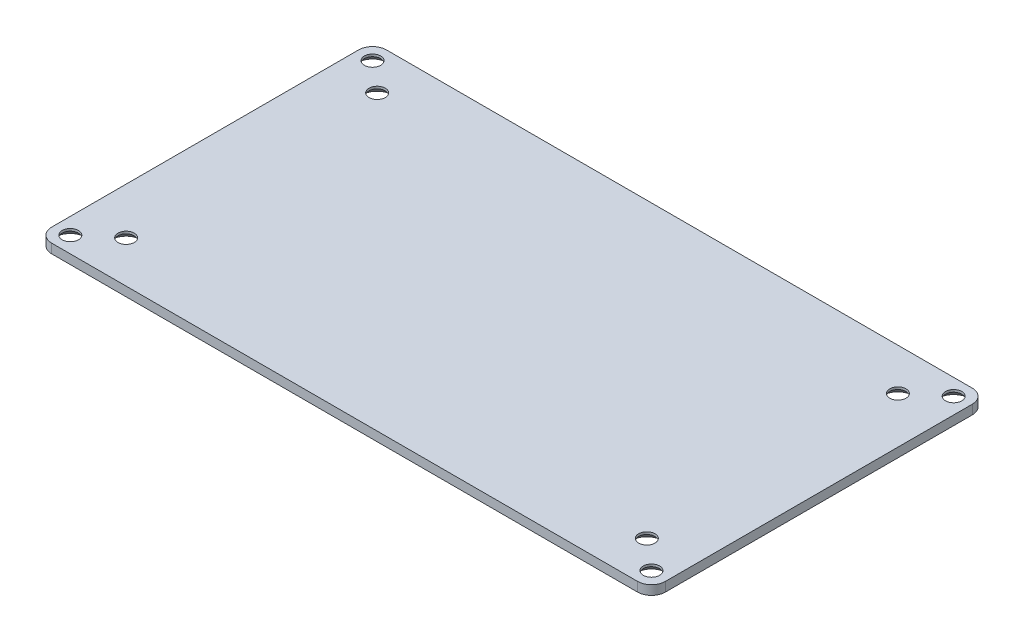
ISO-10303-21;
HEADER;
FILE_DESCRIPTION(('STEP AP214'),'2;1');
FILE_NAME('part.step','',(''),(''),'','','');
FILE_SCHEMA(('AUTOMOTIVE_DESIGN { 1 0 10303 214 1 1 1 1 }'));
ENDSEC;
DATA;
#1=APPLICATION_CONTEXT('core data for automotive mechanical design processes');
#2=APPLICATION_PROTOCOL_DEFINITION('international standard','automotive_design',2000,#1);
#3=PRODUCT_CONTEXT('',#1,'mechanical');
#4=PRODUCT('Part','Part','',(#3));
#5=PRODUCT_RELATED_PRODUCT_CATEGORY('part','',(#4));
#6=PRODUCT_DEFINITION_FORMATION('','',#4);
#7=PRODUCT_DEFINITION_CONTEXT('part definition',#1,'design');
#8=PRODUCT_DEFINITION('design','',#6,#7);
#9=PRODUCT_DEFINITION_SHAPE('','',#8);
#10=(LENGTH_UNIT() NAMED_UNIT(*) SI_UNIT(.MILLI.,.METRE.));
#11=(NAMED_UNIT(*) PLANE_ANGLE_UNIT() SI_UNIT($,.RADIAN.));
#12=(NAMED_UNIT(*) SI_UNIT($,.STERADIAN.) SOLID_ANGLE_UNIT());
#13=UNCERTAINTY_MEASURE_WITH_UNIT(LENGTH_MEASURE(1.E-05),#10,'distance_accuracy_value','');
#14=(GEOMETRIC_REPRESENTATION_CONTEXT(3) GLOBAL_UNCERTAINTY_ASSIGNED_CONTEXT((#13)) GLOBAL_UNIT_ASSIGNED_CONTEXT((#10,
#11,#12)) REPRESENTATION_CONTEXT('',''));
#15=CARTESIAN_POINT('',(0.,0.,0.));
#16=DIRECTION('',(0.,0.,1.));
#17=DIRECTION('',(1.,0.,0.));
#18=AXIS2_PLACEMENT_3D('',#15,#16,#17);
#19=CARTESIAN_POINT('',(-63.,2.,33.));
#20=DIRECTION('',(0.,-1.,0.));
#21=DIRECTION('',(0.,0.,-1.));
#22=AXIS2_PLACEMENT_3D('',#19,#20,#21);
#23=CYLINDRICAL_SURFACE('',#22,3.);
#24=CARTESIAN_POINT('',(-63.,0.,33.));
#25=DIRECTION('',(0.,1.,0.));
#26=DIRECTION('',(0.,0.,1.));
#27=AXIS2_PLACEMENT_3D('',#24,#25,#26);
#28=CIRCLE('',#27,3.);
#29=CARTESIAN_POINT('',(-66.,0.,33.));
#30=VERTEX_POINT('',#29);
#31=CARTESIAN_POINT('',(-63.,0.,36.));
#32=VERTEX_POINT('',#31);
#33=EDGE_CURVE('E135',#30,#32,#28,.T.);
#34=ORIENTED_EDGE('',*,*,#33,.T.);
#35=DIRECTION('',(0.,-1.,0.));
#36=VECTOR('',#35,1.);
#37=CARTESIAN_POINT('',(-63.,2.,36.));
#38=LINE('',#37,#36);
#39=CARTESIAN_POINT('',(-63.,2.,36.));
#40=VERTEX_POINT('',#39);
#41=EDGE_CURVE('E163',#40,#32,#38,.T.);
#42=ORIENTED_EDGE('',*,*,#41,.F.);
#43=CARTESIAN_POINT('',(-63.,2.,33.));
#44=DIRECTION('',(0.,1.,0.));
#45=DIRECTION('',(0.,0.,1.));
#46=AXIS2_PLACEMENT_3D('',#43,#44,#45);
#47=CIRCLE('',#46,3.);
#48=CARTESIAN_POINT('',(-66.,2.,33.));
#49=VERTEX_POINT('',#48);
#50=EDGE_CURVE('E150',#49,#40,#47,.T.);
#51=ORIENTED_EDGE('',*,*,#50,.F.);
#52=DIRECTION('',(0.,-1.,0.));
#53=VECTOR('',#52,1.);
#54=CARTESIAN_POINT('',(-66.,2.,33.));
#55=LINE('',#54,#53);
#56=EDGE_CURVE('E130',#49,#30,#55,.T.);
#57=ORIENTED_EDGE('',*,*,#56,.T.);
#58=EDGE_LOOP('',(#34,#42,#51,#57));
#59=FACE_BOUND('',#58,.T.);
#60=ADVANCED_FACE('F37',(#59),#23,.T.);
#61=CARTESIAN_POINT('',(-63.,2.,36.));
#62=DIRECTION('',(0.,0.,-1.));
#63=DIRECTION('',(-1.,0.,0.));
#64=AXIS2_PLACEMENT_3D('',#61,#62,#63);
#65=PLANE('',#64);
#66=DIRECTION('',(1.,0.,0.));
#67=VECTOR('',#66,1.);
#68=CARTESIAN_POINT('',(-63.,0.,36.));
#69=LINE('',#68,#67);
#70=CARTESIAN_POINT('',(63.,0.,36.));
#71=VERTEX_POINT('',#70);
#72=EDGE_CURVE('E138',#32,#71,#69,.T.);
#73=ORIENTED_EDGE('',*,*,#72,.T.);
#74=DIRECTION('',(0.,-1.,0.));
#75=VECTOR('',#74,1.);
#76=CARTESIAN_POINT('',(63.,2.,36.));
#77=LINE('',#76,#75);
#78=CARTESIAN_POINT('',(63.,2.,36.));
#79=VERTEX_POINT('',#78);
#80=EDGE_CURVE('E160',#79,#71,#77,.T.);
#81=ORIENTED_EDGE('',*,*,#80,.F.);
#82=DIRECTION('',(1.,0.,0.));
#83=VECTOR('',#82,1.);
#84=CARTESIAN_POINT('',(-63.,2.,36.));
#85=LINE('',#84,#83);
#86=EDGE_CURVE('E98',#40,#79,#85,.T.);
#87=ORIENTED_EDGE('',*,*,#86,.F.);
#88=ORIENTED_EDGE('',*,*,#41,.T.);
#89=EDGE_LOOP('',(#73,#81,#87,#88));
#90=FACE_BOUND('',#89,.T.);
#91=ADVANCED_FACE('F350',(#90),#65,.F.);
#92=CARTESIAN_POINT('',(63.,2.,33.));
#93=DIRECTION('',(0.,-1.,0.));
#94=DIRECTION('',(0.,0.,-1.));
#95=AXIS2_PLACEMENT_3D('',#92,#93,#94);
#96=CYLINDRICAL_SURFACE('',#95,3.);
#97=CARTESIAN_POINT('',(63.,0.,33.));
#98=DIRECTION('',(0.,1.,0.));
#99=DIRECTION('',(0.,0.,1.));
#100=AXIS2_PLACEMENT_3D('',#97,#98,#99);
#101=CIRCLE('',#100,3.);
#102=CARTESIAN_POINT('',(66.,0.,33.));
#103=VERTEX_POINT('',#102);
#104=EDGE_CURVE('E141',#71,#103,#101,.T.);
#105=ORIENTED_EDGE('',*,*,#104,.T.);
#106=DIRECTION('',(0.,-1.,0.));
#107=VECTOR('',#106,1.);
#108=CARTESIAN_POINT('',(66.,2.,33.));
#109=LINE('',#108,#107);
#110=CARTESIAN_POINT('',(66.,2.,33.));
#111=VERTEX_POINT('',#110);
#112=EDGE_CURVE('E157',#111,#103,#109,.T.);
#113=ORIENTED_EDGE('',*,*,#112,.F.);
#114=CARTESIAN_POINT('',(63.,2.,33.));
#115=DIRECTION('',(0.,1.,0.));
#116=DIRECTION('',(0.,0.,1.));
#117=AXIS2_PLACEMENT_3D('',#114,#115,#116);
#118=CIRCLE('',#117,3.);
#119=EDGE_CURVE('E648',#79,#111,#118,.T.);
#120=ORIENTED_EDGE('',*,*,#119,.F.);
#121=ORIENTED_EDGE('',*,*,#80,.T.);
#122=EDGE_LOOP('',(#105,#113,#120,#121));
#123=FACE_BOUND('',#122,.T.);
#124=ADVANCED_FACE('F355',(#123),#96,.T.);
#125=CARTESIAN_POINT('',(66.,2.,-33.));
#126=DIRECTION('',(-1.,0.,0.));
#127=DIRECTION('',(0.,0.,1.));
#128=AXIS2_PLACEMENT_3D('',#125,#126,#127);
#129=PLANE('',#128);
#130=DIRECTION('',(0.,0.,-1.));
#131=VECTOR('',#130,1.);
#132=CARTESIAN_POINT('',(66.,0.,-33.));
#133=LINE('',#132,#131);
#134=CARTESIAN_POINT('',(66.,0.,-33.));
#135=VERTEX_POINT('',#134);
#136=EDGE_CURVE('E143',#103,#135,#133,.T.);
#137=ORIENTED_EDGE('',*,*,#136,.T.);
#138=DIRECTION('',(0.,-1.,0.));
#139=VECTOR('',#138,1.);
#140=CARTESIAN_POINT('',(66.,2.,-33.));
#141=LINE('',#140,#139);
#142=CARTESIAN_POINT('',(66.,2.,-33.));
#143=VERTEX_POINT('',#142);
#144=EDGE_CURVE('E154',#143,#135,#141,.T.);
#145=ORIENTED_EDGE('',*,*,#144,.F.);
#146=DIRECTION('',(0.,0.,-1.));
#147=VECTOR('',#146,1.);
#148=CARTESIAN_POINT('',(66.,2.,-33.));
#149=LINE('',#148,#147);
#150=EDGE_CURVE('E646',#111,#143,#149,.T.);
#151=ORIENTED_EDGE('',*,*,#150,.F.);
#152=ORIENTED_EDGE('',*,*,#112,.T.);
#153=EDGE_LOOP('',(#137,#145,#151,#152));
#154=FACE_BOUND('',#153,.T.);
#155=ADVANCED_FACE('F608',(#154),#129,.F.);
#156=CARTESIAN_POINT('',(63.,2.,-33.));
#157=DIRECTION('',(0.,-1.,0.));
#158=DIRECTION('',(0.,0.,-1.));
#159=AXIS2_PLACEMENT_3D('',#156,#157,#158);
#160=CYLINDRICAL_SURFACE('',#159,3.);
#161=CARTESIAN_POINT('',(63.,0.,-33.));
#162=DIRECTION('',(0.,1.,0.));
#163=DIRECTION('',(0.,0.,-1.));
#164=AXIS2_PLACEMENT_3D('',#161,#162,#163);
#165=CIRCLE('',#164,3.);
#166=CARTESIAN_POINT('',(63.,0.,-36.));
#167=VERTEX_POINT('',#166);
#168=EDGE_CURVE('E145',#135,#167,#165,.T.);
#169=ORIENTED_EDGE('',*,*,#168,.T.);
#170=DIRECTION('',(0.,-1.,0.));
#171=VECTOR('',#170,1.);
#172=CARTESIAN_POINT('',(63.,2.,-36.));
#173=LINE('',#172,#171);
#174=CARTESIAN_POINT('',(63.,2.,-36.));
#175=VERTEX_POINT('',#174);
#176=EDGE_CURVE('E125',#175,#167,#173,.T.);
#177=ORIENTED_EDGE('',*,*,#176,.F.);
#178=CARTESIAN_POINT('',(63.,2.,-33.));
#179=DIRECTION('',(0.,1.,0.));
#180=DIRECTION('',(0.,0.,-1.));
#181=AXIS2_PLACEMENT_3D('',#178,#179,#180);
#182=CIRCLE('',#181,3.);
#183=EDGE_CURVE('E117',#143,#175,#182,.T.);
#184=ORIENTED_EDGE('',*,*,#183,.F.);
#185=ORIENTED_EDGE('',*,*,#144,.T.);
#186=EDGE_LOOP('',(#169,#177,#184,#185));
#187=FACE_BOUND('',#186,.T.);
#188=ADVANCED_FACE('F600',(#187),#160,.T.);
#189=CARTESIAN_POINT('',(-63.,2.,-36.));
#190=DIRECTION('',(0.,0.,1.));
#191=DIRECTION('',(1.,0.,0.));
#192=AXIS2_PLACEMENT_3D('',#189,#190,#191);
#193=PLANE('',#192);
#194=DIRECTION('',(-1.,0.,0.));
#195=VECTOR('',#194,1.);
#196=CARTESIAN_POINT('',(-63.,0.,-36.));
#197=LINE('',#196,#195);
#198=CARTESIAN_POINT('',(-63.,0.,-36.));
#199=VERTEX_POINT('',#198);
#200=EDGE_CURVE('E124',#167,#199,#197,.T.);
#201=ORIENTED_EDGE('',*,*,#200,.T.);
#202=DIRECTION('',(0.,-1.,0.));
#203=VECTOR('',#202,1.);
#204=CARTESIAN_POINT('',(-63.,2.,-36.));
#205=LINE('',#204,#203);
#206=CARTESIAN_POINT('',(-63.,2.,-36.));
#207=VERTEX_POINT('',#206);
#208=EDGE_CURVE('E121',#207,#199,#205,.T.);
#209=ORIENTED_EDGE('',*,*,#208,.F.);
#210=DIRECTION('',(-1.,0.,0.));
#211=VECTOR('',#210,1.);
#212=CARTESIAN_POINT('',(-63.,2.,-36.));
#213=LINE('',#212,#211);
#214=EDGE_CURVE('E111',#175,#207,#213,.T.);
#215=ORIENTED_EDGE('',*,*,#214,.F.);
#216=ORIENTED_EDGE('',*,*,#176,.T.);
#217=EDGE_LOOP('',(#201,#209,#215,#216));
#218=FACE_BOUND('',#217,.T.);
#219=ADVANCED_FACE('F122',(#218),#193,.F.);
#220=CARTESIAN_POINT('',(-63.,2.,-33.));
#221=DIRECTION('',(0.,-1.,0.));
#222=DIRECTION('',(0.,0.,-1.));
#223=AXIS2_PLACEMENT_3D('',#220,#221,#222);
#224=CYLINDRICAL_SURFACE('',#223,3.);
#225=CARTESIAN_POINT('',(-63.,0.,-33.));
#226=DIRECTION('',(0.,1.,0.));
#227=DIRECTION('',(0.,0.,1.));
#228=AXIS2_PLACEMENT_3D('',#225,#226,#227);
#229=CIRCLE('',#228,3.);
#230=CARTESIAN_POINT('',(-66.,0.,-33.));
#231=VERTEX_POINT('',#230);
#232=EDGE_CURVE('E83',#199,#231,#229,.T.);
#233=ORIENTED_EDGE('',*,*,#232,.T.);
#234=DIRECTION('',(0.,-1.,0.));
#235=VECTOR('',#234,1.);
#236=CARTESIAN_POINT('',(-66.,2.,-33.));
#237=LINE('',#236,#235);
#238=CARTESIAN_POINT('',(-66.,2.,-33.));
#239=VERTEX_POINT('',#238);
#240=EDGE_CURVE('E126',#239,#231,#237,.T.);
#241=ORIENTED_EDGE('',*,*,#240,.F.);
#242=CARTESIAN_POINT('',(-63.,2.,-33.));
#243=DIRECTION('',(0.,1.,0.));
#244=DIRECTION('',(0.,0.,1.));
#245=AXIS2_PLACEMENT_3D('',#242,#243,#244);
#246=CIRCLE('',#245,3.);
#247=EDGE_CURVE('E115',#207,#239,#246,.T.);
#248=ORIENTED_EDGE('',*,*,#247,.F.);
#249=ORIENTED_EDGE('',*,*,#208,.T.);
#250=EDGE_LOOP('',(#233,#241,#248,#249));
#251=FACE_BOUND('',#250,.T.);
#252=ADVANCED_FACE('F128',(#251),#224,.T.);
#253=CARTESIAN_POINT('',(-66.,2.,-33.));
#254=DIRECTION('',(1.,0.,0.));
#255=DIRECTION('',(0.,0.,-1.));
#256=AXIS2_PLACEMENT_3D('',#253,#254,#255);
#257=PLANE('',#256);
#258=DIRECTION('',(0.,0.,1.));
#259=VECTOR('',#258,1.);
#260=CARTESIAN_POINT('',(-66.,0.,-33.));
#261=LINE('',#260,#259);
#262=EDGE_CURVE('E89',#231,#30,#261,.T.);
#263=ORIENTED_EDGE('',*,*,#262,.T.);
#264=ORIENTED_EDGE('',*,*,#56,.F.);
#265=DIRECTION('',(0.,0.,1.));
#266=VECTOR('',#265,1.);
#267=CARTESIAN_POINT('',(-66.,2.,-33.));
#268=LINE('',#267,#266);
#269=EDGE_CURVE('E54',#239,#49,#268,.T.);
#270=ORIENTED_EDGE('',*,*,#269,.F.);
#271=ORIENTED_EDGE('',*,*,#240,.T.);
#272=EDGE_LOOP('',(#263,#264,#270,#271));
#273=FACE_BOUND('',#272,.T.);
#274=ADVANCED_FACE('F339',(#273),#257,.F.);
#275=CARTESIAN_POINT('',(-63.,2.,33.));
#276=DIRECTION('',(0.,1.,0.));
#277=DIRECTION('',(0.,0.,1.));
#278=AXIS2_PLACEMENT_3D('',#275,#276,#277);
#279=PLANE('',#278);
#280=CARTESIAN_POINT('',(-56.,2.,27.));
#281=DIRECTION('',(0.,1.,0.));
#282=DIRECTION('',(0.,0.,1.));
#283=AXIS2_PLACEMENT_3D('',#280,#281,#282);
#284=CIRCLE('',#283,1.75);
#285=CARTESIAN_POINT('',(-56.,2.,28.75));
#286=VERTEX_POINT('',#285);
#287=EDGE_CURVE('E257',#286,#286,#284,.T.);
#288=ORIENTED_EDGE('',*,*,#287,.F.);
#289=EDGE_LOOP('',(#288));
#290=FACE_BOUND('',#289,.T.);
#291=CARTESIAN_POINT('',(56.,2.,27.));
#292=DIRECTION('',(0.,1.,0.));
#293=DIRECTION('',(0.,0.,1.));
#294=AXIS2_PLACEMENT_3D('',#291,#292,#293);
#295=CIRCLE('',#294,1.75);
#296=CARTESIAN_POINT('',(56.,2.,28.75));
#297=VERTEX_POINT('',#296);
#298=EDGE_CURVE('E267',#297,#297,#295,.T.);
#299=ORIENTED_EDGE('',*,*,#298,.F.);
#300=EDGE_LOOP('',(#299));
#301=FACE_BOUND('',#300,.T.);
#302=CARTESIAN_POINT('',(56.,2.,-27.));
#303=DIRECTION('',(0.,1.,0.));
#304=DIRECTION('',(0.,0.,1.));
#305=AXIS2_PLACEMENT_3D('',#302,#303,#304);
#306=CIRCLE('',#305,1.75);
#307=CARTESIAN_POINT('',(56.,2.,-25.25));
#308=VERTEX_POINT('',#307);
#309=EDGE_CURVE('E256',#308,#308,#306,.T.);
#310=ORIENTED_EDGE('',*,*,#309,.F.);
#311=EDGE_LOOP('',(#310));
#312=FACE_BOUND('',#311,.T.);
#313=CARTESIAN_POINT('',(-56.,2.,-27.));
#314=DIRECTION('',(0.,1.,0.));
#315=DIRECTION('',(0.,0.,1.));
#316=AXIS2_PLACEMENT_3D('',#313,#314,#315);
#317=CIRCLE('',#316,1.75);
#318=CARTESIAN_POINT('',(-56.,2.,-25.25));
#319=VERTEX_POINT('',#318);
#320=EDGE_CURVE('E242',#319,#319,#317,.T.);
#321=ORIENTED_EDGE('',*,*,#320,.F.);
#322=EDGE_LOOP('',(#321));
#323=FACE_BOUND('',#322,.T.);
#324=CARTESIAN_POINT('',(-62.5,2.,32.5));
#325=DIRECTION('',(0.,1.,0.));
#326=DIRECTION('',(0.,0.,1.));
#327=AXIS2_PLACEMENT_3D('',#324,#325,#326);
#328=CIRCLE('',#327,1.75);
#329=CARTESIAN_POINT('',(-62.5,2.,34.25));
#330=VERTEX_POINT('',#329);
#331=EDGE_CURVE('E236',#330,#330,#328,.T.);
#332=ORIENTED_EDGE('',*,*,#331,.F.);
#333=EDGE_LOOP('',(#332));
#334=FACE_BOUND('',#333,.T.);
#335=CARTESIAN_POINT('',(62.5,2.,32.5));
#336=DIRECTION('',(0.,1.,0.));
#337=DIRECTION('',(0.,0.,1.));
#338=AXIS2_PLACEMENT_3D('',#335,#336,#337);
#339=CIRCLE('',#338,1.75);
#340=CARTESIAN_POINT('',(62.5,2.,34.25));
#341=VERTEX_POINT('',#340);
#342=EDGE_CURVE('E241',#341,#341,#339,.T.);
#343=ORIENTED_EDGE('',*,*,#342,.F.);
#344=EDGE_LOOP('',(#343));
#345=FACE_BOUND('',#344,.T.);
#346=CARTESIAN_POINT('',(62.5,2.,-32.5));
#347=DIRECTION('',(0.,1.,0.));
#348=DIRECTION('',(0.,0.,1.));
#349=AXIS2_PLACEMENT_3D('',#346,#347,#348);
#350=CIRCLE('',#349,1.75);
#351=CARTESIAN_POINT('',(62.5,2.,-30.75));
#352=VERTEX_POINT('',#351);
#353=EDGE_CURVE('E248',#352,#352,#350,.T.);
#354=ORIENTED_EDGE('',*,*,#353,.F.);
#355=EDGE_LOOP('',(#354));
#356=FACE_BOUND('',#355,.T.);
#357=CARTESIAN_POINT('',(-62.5,2.,-32.5));
#358=DIRECTION('',(0.,1.,0.));
#359=DIRECTION('',(0.,0.,1.));
#360=AXIS2_PLACEMENT_3D('',#357,#358,#359);
#361=CIRCLE('',#360,1.75);
#362=CARTESIAN_POINT('',(-62.5,2.,-30.75));
#363=VERTEX_POINT('',#362);
#364=EDGE_CURVE('E139',#363,#363,#361,.T.);
#365=ORIENTED_EDGE('',*,*,#364,.F.);
#366=EDGE_LOOP('',(#365));
#367=FACE_BOUND('',#366,.T.);
#368=ORIENTED_EDGE('',*,*,#50,.T.);
#369=ORIENTED_EDGE('',*,*,#86,.T.);
#370=ORIENTED_EDGE('',*,*,#119,.T.);
#371=ORIENTED_EDGE('',*,*,#150,.T.);
#372=ORIENTED_EDGE('',*,*,#183,.T.);
#373=ORIENTED_EDGE('',*,*,#214,.T.);
#374=ORIENTED_EDGE('',*,*,#247,.T.);
#375=ORIENTED_EDGE('',*,*,#269,.T.);
#376=EDGE_LOOP('',(#368,#369,#370,#371,#372,#373,#374,#375));
#377=FACE_BOUND('',#376,.T.);
#378=ADVANCED_FACE('F113',(#290,#301,#312,#323,#334,#345,#356,#367,#377),#279,.T.);
#379=CARTESIAN_POINT('',(-63.,0.,33.));
#380=DIRECTION('',(0.,1.,0.));
#381=DIRECTION('',(0.,0.,1.));
#382=AXIS2_PLACEMENT_3D('',#379,#380,#381);
#383=PLANE('',#382);
#384=CARTESIAN_POINT('',(45.,0.,25.));
#385=DIRECTION('',(0.,-1.,0.));
#386=DIRECTION('',(0.,0.,-1.));
#387=AXIS2_PLACEMENT_3D('',#384,#385,#386);
#388=CIRCLE('',#387,6.25);
#389=CARTESIAN_POINT('',(45.,0.,18.75));
#390=VERTEX_POINT('',#389);
#391=EDGE_CURVE('E291',#390,#390,#388,.T.);
#392=ORIENTED_EDGE('',*,*,#391,.F.);
#393=EDGE_LOOP('',(#392));
#394=FACE_BOUND('',#393,.T.);
#395=CARTESIAN_POINT('',(-45.,0.,-25.));
#396=DIRECTION('',(0.,-1.,0.));
#397=DIRECTION('',(0.,0.,-1.));
#398=AXIS2_PLACEMENT_3D('',#395,#396,#397);
#399=CIRCLE('',#398,6.25);
#400=CARTESIAN_POINT('',(-45.,0.,-31.25));
#401=VERTEX_POINT('',#400);
#402=EDGE_CURVE('E284',#401,#401,#399,.T.);
#403=ORIENTED_EDGE('',*,*,#402,.F.);
#404=EDGE_LOOP('',(#403));
#405=FACE_BOUND('',#404,.T.);
#406=CARTESIAN_POINT('',(45.,0.,-25.));
#407=DIRECTION('',(0.,-1.,0.));
#408=DIRECTION('',(0.,0.,-1.));
#409=AXIS2_PLACEMENT_3D('',#406,#407,#408);
#410=CIRCLE('',#409,6.25);
#411=CARTESIAN_POINT('',(45.,0.,-31.25));
#412=VERTEX_POINT('',#411);
#413=EDGE_CURVE('E296',#412,#412,#410,.T.);
#414=ORIENTED_EDGE('',*,*,#413,.F.);
#415=EDGE_LOOP('',(#414));
#416=FACE_BOUND('',#415,.T.);
#417=CARTESIAN_POINT('',(-45.,0.,25.));
#418=DIRECTION('',(0.,-1.,0.));
#419=DIRECTION('',(0.,0.,-1.));
#420=AXIS2_PLACEMENT_3D('',#417,#418,#419);
#421=CIRCLE('',#420,6.25);
#422=CARTESIAN_POINT('',(-45.,0.,18.75));
#423=VERTEX_POINT('',#422);
#424=EDGE_CURVE('E268',#423,#423,#421,.T.);
#425=ORIENTED_EDGE('',*,*,#424,.F.);
#426=EDGE_LOOP('',(#425));
#427=FACE_BOUND('',#426,.T.);
#428=CARTESIAN_POINT('',(-56.,0.,-27.));
#429=DIRECTION('',(0.,1.,0.));
#430=DIRECTION('',(0.,0.,1.));
#431=AXIS2_PLACEMENT_3D('',#428,#429,#430);
#432=CIRCLE('',#431,3.25000000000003);
#433=CARTESIAN_POINT('',(-56.,0.,-23.75));
#434=VERTEX_POINT('',#433);
#435=EDGE_CURVE('E180',#434,#434,#432,.T.);
#436=ORIENTED_EDGE('',*,*,#435,.T.);
#437=EDGE_LOOP('',(#436));
#438=FACE_BOUND('',#437,.T.);
#439=CARTESIAN_POINT('',(56.,0.,-27.));
#440=DIRECTION('',(0.,1.,0.));
#441=DIRECTION('',(0.,0.,1.));
#442=AXIS2_PLACEMENT_3D('',#439,#440,#441);
#443=CIRCLE('',#442,3.25000000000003);
#444=CARTESIAN_POINT('',(56.,0.,-23.75));
#445=VERTEX_POINT('',#444);
#446=EDGE_CURVE('E186',#445,#445,#443,.T.);
#447=ORIENTED_EDGE('',*,*,#446,.T.);
#448=EDGE_LOOP('',(#447));
#449=FACE_BOUND('',#448,.T.);
#450=CARTESIAN_POINT('',(56.,0.,27.));
#451=DIRECTION('',(0.,1.,0.));
#452=DIRECTION('',(0.,0.,1.));
#453=AXIS2_PLACEMENT_3D('',#450,#451,#452);
#454=CIRCLE('',#453,3.25);
#455=CARTESIAN_POINT('',(56.,0.,30.25));
#456=VERTEX_POINT('',#455);
#457=EDGE_CURVE('E326',#456,#456,#454,.T.);
#458=ORIENTED_EDGE('',*,*,#457,.T.);
#459=EDGE_LOOP('',(#458));
#460=FACE_BOUND('',#459,.T.);
#461=CARTESIAN_POINT('',(-56.,0.,27.));
#462=DIRECTION('',(0.,1.,0.));
#463=DIRECTION('',(0.,0.,1.));
#464=AXIS2_PLACEMENT_3D('',#461,#462,#463);
#465=CIRCLE('',#464,3.25);
#466=CARTESIAN_POINT('',(-56.,0.,30.25));
#467=VERTEX_POINT('',#466);
#468=EDGE_CURVE('E224',#467,#467,#465,.T.);
#469=ORIENTED_EDGE('',*,*,#468,.T.);
#470=EDGE_LOOP('',(#469));
#471=FACE_BOUND('',#470,.T.);
#472=CARTESIAN_POINT('',(62.5,0.,-32.5));
#473=DIRECTION('',(0.,1.,0.));
#474=DIRECTION('',(0.,0.,1.));
#475=AXIS2_PLACEMENT_3D('',#472,#473,#474);
#476=CIRCLE('',#475,3.25);
#477=CARTESIAN_POINT('',(62.5,0.,-29.25));
#478=VERTEX_POINT('',#477);
#479=EDGE_CURVE('E220',#478,#478,#476,.T.);
#480=ORIENTED_EDGE('',*,*,#479,.T.);
#481=EDGE_LOOP('',(#480));
#482=FACE_BOUND('',#481,.T.);
#483=CARTESIAN_POINT('',(62.5,0.,32.5));
#484=DIRECTION('',(0.,1.,0.));
#485=DIRECTION('',(0.,0.,1.));
#486=AXIS2_PLACEMENT_3D('',#483,#484,#485);
#487=CIRCLE('',#486,3.25);
#488=CARTESIAN_POINT('',(62.5,0.,35.75));
#489=VERTEX_POINT('',#488);
#490=EDGE_CURVE('E218',#489,#489,#487,.T.);
#491=ORIENTED_EDGE('',*,*,#490,.T.);
#492=EDGE_LOOP('',(#491));
#493=FACE_BOUND('',#492,.T.);
#494=CARTESIAN_POINT('',(-62.5,0.,-32.5));
#495=DIRECTION('',(0.,1.,0.));
#496=DIRECTION('',(0.,0.,1.));
#497=AXIS2_PLACEMENT_3D('',#494,#495,#496);
#498=CIRCLE('',#497,3.25000000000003);
#499=CARTESIAN_POINT('',(-62.5,0.,-29.25));
#500=VERTEX_POINT('',#499);
#501=EDGE_CURVE('E169',#500,#500,#498,.T.);
#502=ORIENTED_EDGE('',*,*,#501,.T.);
#503=EDGE_LOOP('',(#502));
#504=FACE_BOUND('',#503,.T.);
#505=CARTESIAN_POINT('',(-62.5,0.,32.5));
#506=DIRECTION('',(0.,1.,0.));
#507=DIRECTION('',(0.,0.,1.));
#508=AXIS2_PLACEMENT_3D('',#505,#506,#507);
#509=CIRCLE('',#508,3.25);
#510=CARTESIAN_POINT('',(-62.5,0.,35.75));
#511=VERTEX_POINT('',#510);
#512=EDGE_CURVE('E165',#511,#511,#509,.T.);
#513=ORIENTED_EDGE('',*,*,#512,.T.);
#514=EDGE_LOOP('',(#513));
#515=FACE_BOUND('',#514,.T.);
#516=ORIENTED_EDGE('',*,*,#33,.F.);
#517=ORIENTED_EDGE('',*,*,#262,.F.);
#518=ORIENTED_EDGE('',*,*,#232,.F.);
#519=ORIENTED_EDGE('',*,*,#200,.F.);
#520=ORIENTED_EDGE('',*,*,#168,.F.);
#521=ORIENTED_EDGE('',*,*,#136,.F.);
#522=ORIENTED_EDGE('',*,*,#104,.F.);
#523=ORIENTED_EDGE('',*,*,#72,.F.);
#524=EDGE_LOOP('',(#516,#517,#518,#519,#520,#521,#522,#523));
#525=FACE_BOUND('',#524,.T.);
#526=ADVANCED_FACE('F311',(#394,#405,#416,#427,#438,#449,#460,#471,#482,#493,#504,#515,#525),
#383,.F.);
#527=CARTESIAN_POINT('',(-62.5,0.,-32.5));
#528=DIRECTION('',(0.,1.,0.));
#529=DIRECTION('',(0.,0.,1.));
#530=AXIS2_PLACEMENT_3D('',#527,#528,#529);
#531=CYLINDRICAL_SURFACE('',#530,1.75);
#532=CARTESIAN_POINT('',(-62.5,1.50000000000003,-32.5));
#533=DIRECTION('',(0.,1.,0.));
#534=DIRECTION('',(0.,0.,1.));
#535=AXIS2_PLACEMENT_3D('',#532,#533,#534);
#536=CIRCLE('',#535,1.75);
#537=CARTESIAN_POINT('',(-62.5,1.50000000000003,-30.75));
#538=VERTEX_POINT('',#537);
#539=EDGE_CURVE('E46',#538,#538,#536,.F.);
#540=ORIENTED_EDGE('',*,*,#539,.T.);
#541=EDGE_LOOP('',(#540));
#542=FACE_BOUND('',#541,.T.);
#543=ORIENTED_EDGE('',*,*,#364,.T.);
#544=EDGE_LOOP('',(#543));
#545=FACE_BOUND('',#544,.T.);
#546=ADVANCED_FACE('F208',(#542,#545),#531,.F.);
#547=CARTESIAN_POINT('',(62.5,0.,-32.5));
#548=DIRECTION('',(0.,1.,0.));
#549=DIRECTION('',(0.,0.,1.));
#550=AXIS2_PLACEMENT_3D('',#547,#548,#549);
#551=CYLINDRICAL_SURFACE('',#550,1.75);
#552=CARTESIAN_POINT('',(62.5,1.5,-32.5));
#553=DIRECTION('',(0.,1.,0.));
#554=DIRECTION('',(0.,0.,1.));
#555=AXIS2_PLACEMENT_3D('',#552,#553,#554);
#556=CIRCLE('',#555,1.75);
#557=CARTESIAN_POINT('',(62.5,1.5,-30.75));
#558=VERTEX_POINT('',#557);
#559=EDGE_CURVE('E200',#558,#558,#556,.F.);
#560=ORIENTED_EDGE('',*,*,#559,.T.);
#561=EDGE_LOOP('',(#560));
#562=FACE_BOUND('',#561,.T.);
#563=ORIENTED_EDGE('',*,*,#353,.T.);
#564=EDGE_LOOP('',(#563));
#565=FACE_BOUND('',#564,.T.);
#566=ADVANCED_FACE('F391',(#562,#565),#551,.F.);
#567=CARTESIAN_POINT('',(62.5,0.,32.5));
#568=DIRECTION('',(0.,1.,0.));
#569=DIRECTION('',(0.,0.,1.));
#570=AXIS2_PLACEMENT_3D('',#567,#568,#569);
#571=CYLINDRICAL_SURFACE('',#570,1.75);
#572=CARTESIAN_POINT('',(62.5,1.5,32.5));
#573=DIRECTION('',(0.,1.,0.));
#574=DIRECTION('',(0.,0.,1.));
#575=AXIS2_PLACEMENT_3D('',#572,#573,#574);
#576=CIRCLE('',#575,1.75);
#577=CARTESIAN_POINT('',(62.5,1.5,34.25));
#578=VERTEX_POINT('',#577);
#579=EDGE_CURVE('E203',#578,#578,#576,.F.);
#580=ORIENTED_EDGE('',*,*,#579,.T.);
#581=EDGE_LOOP('',(#580));
#582=FACE_BOUND('',#581,.T.);
#583=ORIENTED_EDGE('',*,*,#342,.T.);
#584=EDGE_LOOP('',(#583));
#585=FACE_BOUND('',#584,.T.);
#586=ADVANCED_FACE('F387',(#582,#585),#571,.F.);
#587=CARTESIAN_POINT('',(-62.5,0.,32.5));
#588=DIRECTION('',(0.,1.,0.));
#589=DIRECTION('',(0.,0.,1.));
#590=AXIS2_PLACEMENT_3D('',#587,#588,#589);
#591=CYLINDRICAL_SURFACE('',#590,1.75);
#592=CARTESIAN_POINT('',(-62.5,1.49999999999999,32.5));
#593=DIRECTION('',(0.,1.,0.));
#594=DIRECTION('',(0.,0.,1.));
#595=AXIS2_PLACEMENT_3D('',#592,#593,#594);
#596=CIRCLE('',#595,1.75);
#597=CARTESIAN_POINT('',(-62.5,1.49999999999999,34.25));
#598=VERTEX_POINT('',#597);
#599=EDGE_CURVE('E12',#598,#598,#596,.F.);
#600=ORIENTED_EDGE('',*,*,#599,.T.);
#601=EDGE_LOOP('',(#600));
#602=FACE_BOUND('',#601,.T.);
#603=ORIENTED_EDGE('',*,*,#331,.T.);
#604=EDGE_LOOP('',(#603));
#605=FACE_BOUND('',#604,.T.);
#606=ADVANCED_FACE('F390',(#602,#605),#591,.F.);
#607=CARTESIAN_POINT('',(-56.,0.,-27.));
#608=DIRECTION('',(0.,1.,0.));
#609=DIRECTION('',(0.,0.,1.));
#610=AXIS2_PLACEMENT_3D('',#607,#608,#609);
#611=CYLINDRICAL_SURFACE('',#610,1.75);
#612=CARTESIAN_POINT('',(-56.,1.50000000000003,-27.));
#613=DIRECTION('',(0.,1.,0.));
#614=DIRECTION('',(0.,0.,1.));
#615=AXIS2_PLACEMENT_3D('',#612,#613,#614);
#616=CIRCLE('',#615,1.75);
#617=CARTESIAN_POINT('',(-56.,1.50000000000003,-25.25));
#618=VERTEX_POINT('',#617);
#619=EDGE_CURVE('E185',#618,#618,#616,.F.);
#620=ORIENTED_EDGE('',*,*,#619,.T.);
#621=EDGE_LOOP('',(#620));
#622=FACE_BOUND('',#621,.T.);
#623=ORIENTED_EDGE('',*,*,#320,.T.);
#624=EDGE_LOOP('',(#623));
#625=FACE_BOUND('',#624,.T.);
#626=ADVANCED_FACE('F409',(#622,#625),#611,.F.);
#627=CARTESIAN_POINT('',(56.,0.,-27.));
#628=DIRECTION('',(0.,1.,0.));
#629=DIRECTION('',(0.,0.,1.));
#630=AXIS2_PLACEMENT_3D('',#627,#628,#629);
#631=CYLINDRICAL_SURFACE('',#630,1.75);
#632=CARTESIAN_POINT('',(56.,1.50000000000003,-27.));
#633=DIRECTION('',(0.,1.,0.));
#634=DIRECTION('',(0.,0.,1.));
#635=AXIS2_PLACEMENT_3D('',#632,#633,#634);
#636=CIRCLE('',#635,1.75);
#637=CARTESIAN_POINT('',(56.,1.50000000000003,-25.25));
#638=VERTEX_POINT('',#637);
#639=EDGE_CURVE('E191',#638,#638,#636,.F.);
#640=ORIENTED_EDGE('',*,*,#639,.T.);
#641=EDGE_LOOP('',(#640));
#642=FACE_BOUND('',#641,.T.);
#643=ORIENTED_EDGE('',*,*,#309,.T.);
#644=EDGE_LOOP('',(#643));
#645=FACE_BOUND('',#644,.T.);
#646=ADVANCED_FACE('F414',(#642,#645),#631,.F.);
#647=CARTESIAN_POINT('',(56.,0.,27.));
#648=DIRECTION('',(0.,1.,0.));
#649=DIRECTION('',(0.,0.,1.));
#650=AXIS2_PLACEMENT_3D('',#647,#648,#649);
#651=CYLINDRICAL_SURFACE('',#650,1.75);
#652=CARTESIAN_POINT('',(56.,1.49999999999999,27.));
#653=DIRECTION('',(0.,1.,0.));
#654=DIRECTION('',(0.,0.,1.));
#655=AXIS2_PLACEMENT_3D('',#652,#653,#654);
#656=CIRCLE('',#655,1.75);
#657=CARTESIAN_POINT('',(56.,1.49999999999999,28.75));
#658=VERTEX_POINT('',#657);
#659=EDGE_CURVE('E194',#658,#658,#656,.F.);
#660=ORIENTED_EDGE('',*,*,#659,.T.);
#661=EDGE_LOOP('',(#660));
#662=FACE_BOUND('',#661,.T.);
#663=ORIENTED_EDGE('',*,*,#298,.T.);
#664=EDGE_LOOP('',(#663));
#665=FACE_BOUND('',#664,.T.);
#666=ADVANCED_FACE('F418',(#662,#665),#651,.F.);
#667=CARTESIAN_POINT('',(-56.,0.,27.));
#668=DIRECTION('',(0.,1.,0.));
#669=DIRECTION('',(0.,0.,1.));
#670=AXIS2_PLACEMENT_3D('',#667,#668,#669);
#671=CYLINDRICAL_SURFACE('',#670,1.75);
#672=CARTESIAN_POINT('',(-56.,1.49999999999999,27.));
#673=DIRECTION('',(0.,1.,0.));
#674=DIRECTION('',(0.,0.,1.));
#675=AXIS2_PLACEMENT_3D('',#672,#673,#674);
#676=CIRCLE('',#675,1.75);
#677=CARTESIAN_POINT('',(-56.,1.49999999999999,28.75));
#678=VERTEX_POINT('',#677);
#679=EDGE_CURVE('E197',#678,#678,#676,.F.);
#680=ORIENTED_EDGE('',*,*,#679,.T.);
#681=EDGE_LOOP('',(#680));
#682=FACE_BOUND('',#681,.T.);
#683=ORIENTED_EDGE('',*,*,#287,.T.);
#684=EDGE_LOOP('',(#683));
#685=FACE_BOUND('',#684,.T.);
#686=ADVANCED_FACE('F363',(#682,#685),#671,.F.);
#687=CARTESIAN_POINT('',(-56.,0.,-27.));
#688=DIRECTION('',(0.,-1.,0.));
#689=DIRECTION('',(0.,0.,-1.));
#690=AXIS2_PLACEMENT_3D('',#687,#688,#689);
#691=CONICAL_SURFACE('',#690,3.25000000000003,0.785398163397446);
#692=ORIENTED_EDGE('',*,*,#619,.F.);
#693=EDGE_LOOP('',(#692));
#694=FACE_BOUND('',#693,.T.);
#695=ORIENTED_EDGE('',*,*,#435,.F.);
#696=EDGE_LOOP('',(#695));
#697=FACE_BOUND('',#696,.T.);
#698=ADVANCED_FACE('F359',(#694,#697),#691,.F.);
#699=CARTESIAN_POINT('',(56.,0.,-27.));
#700=DIRECTION('',(0.,-1.,0.));
#701=DIRECTION('',(0.,0.,-1.));
#702=AXIS2_PLACEMENT_3D('',#699,#700,#701);
#703=CONICAL_SURFACE('',#702,3.25000000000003,0.785398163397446);
#704=ORIENTED_EDGE('',*,*,#639,.F.);
#705=EDGE_LOOP('',(#704));
#706=FACE_BOUND('',#705,.T.);
#707=ORIENTED_EDGE('',*,*,#446,.F.);
#708=EDGE_LOOP('',(#707));
#709=FACE_BOUND('',#708,.T.);
#710=ADVANCED_FACE('F362',(#706,#709),#703,.F.);
#711=CARTESIAN_POINT('',(56.,0.,27.));
#712=DIRECTION('',(0.,-1.,0.));
#713=DIRECTION('',(0.,0.,-1.));
#714=AXIS2_PLACEMENT_3D('',#711,#712,#713);
#715=CONICAL_SURFACE('',#714,3.25,0.785398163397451);
#716=ORIENTED_EDGE('',*,*,#659,.F.);
#717=EDGE_LOOP('',(#716));
#718=FACE_BOUND('',#717,.T.);
#719=ORIENTED_EDGE('',*,*,#457,.F.);
#720=EDGE_LOOP('',(#719));
#721=FACE_BOUND('',#720,.T.);
#722=ADVANCED_FACE('F367',(#718,#721),#715,.F.);
#723=CARTESIAN_POINT('',(-56.,0.,27.));
#724=DIRECTION('',(0.,-1.,0.));
#725=DIRECTION('',(0.,0.,-1.));
#726=AXIS2_PLACEMENT_3D('',#723,#724,#725);
#727=CONICAL_SURFACE('',#726,3.25,0.785398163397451);
#728=ORIENTED_EDGE('',*,*,#679,.F.);
#729=EDGE_LOOP('',(#728));
#730=FACE_BOUND('',#729,.T.);
#731=ORIENTED_EDGE('',*,*,#468,.F.);
#732=EDGE_LOOP('',(#731));
#733=FACE_BOUND('',#732,.T.);
#734=ADVANCED_FACE('F371',(#730,#733),#727,.F.);
#735=CARTESIAN_POINT('',(62.5,0.,-32.5));
#736=DIRECTION('',(0.,-1.,0.));
#737=DIRECTION('',(0.,0.,-1.));
#738=AXIS2_PLACEMENT_3D('',#735,#736,#737);
#739=CONICAL_SURFACE('',#738,3.25,0.785398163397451);
#740=ORIENTED_EDGE('',*,*,#559,.F.);
#741=EDGE_LOOP('',(#740));
#742=FACE_BOUND('',#741,.T.);
#743=ORIENTED_EDGE('',*,*,#479,.F.);
#744=EDGE_LOOP('',(#743));
#745=FACE_BOUND('',#744,.T.);
#746=ADVANCED_FACE('F375',(#742,#745),#739,.F.);
#747=CARTESIAN_POINT('',(62.5,0.,32.5));
#748=DIRECTION('',(0.,-1.,0.));
#749=DIRECTION('',(0.,0.,-1.));
#750=AXIS2_PLACEMENT_3D('',#747,#748,#749);
#751=CONICAL_SURFACE('',#750,3.25,0.785398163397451);
#752=ORIENTED_EDGE('',*,*,#579,.F.);
#753=EDGE_LOOP('',(#752));
#754=FACE_BOUND('',#753,.T.);
#755=ORIENTED_EDGE('',*,*,#490,.F.);
#756=EDGE_LOOP('',(#755));
#757=FACE_BOUND('',#756,.T.);
#758=ADVANCED_FACE('F214',(#754,#757),#751,.F.);
#759=CARTESIAN_POINT('',(-62.5,0.,-32.5));
#760=DIRECTION('',(0.,-1.,0.));
#761=DIRECTION('',(0.,0.,-1.));
#762=AXIS2_PLACEMENT_3D('',#759,#760,#761);
#763=CONICAL_SURFACE('',#762,3.25000000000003,0.785398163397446);
#764=ORIENTED_EDGE('',*,*,#539,.F.);
#765=EDGE_LOOP('',(#764));
#766=FACE_BOUND('',#765,.T.);
#767=ORIENTED_EDGE('',*,*,#501,.F.);
#768=EDGE_LOOP('',(#767));
#769=FACE_BOUND('',#768,.T.);
#770=ADVANCED_FACE('F211',(#766,#769),#763,.F.);
#771=CARTESIAN_POINT('',(-62.5,0.,32.5));
#772=DIRECTION('',(0.,-1.,0.));
#773=DIRECTION('',(0.,0.,-1.));
#774=AXIS2_PLACEMENT_3D('',#771,#772,#773);
#775=CONICAL_SURFACE('',#774,3.25,0.785398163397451);
#776=ORIENTED_EDGE('',*,*,#599,.F.);
#777=EDGE_LOOP('',(#776));
#778=FACE_BOUND('',#777,.T.);
#779=ORIENTED_EDGE('',*,*,#512,.F.);
#780=EDGE_LOOP('',(#779));
#781=FACE_BOUND('',#780,.T.);
#782=ADVANCED_FACE('F39',(#778,#781),#775,.F.);
#783=CARTESIAN_POINT('',(-45.,1.,25.));
#784=DIRECTION('',(0.,-1.,0.));
#785=DIRECTION('',(0.,0.,-1.));
#786=AXIS2_PLACEMENT_3D('',#783,#784,#785);
#787=CYLINDRICAL_SURFACE('',#786,6.25);
#788=CARTESIAN_POINT('',(-45.,1.,25.));
#789=DIRECTION('',(0.,-1.,0.));
#790=DIRECTION('',(0.,0.,-1.));
#791=AXIS2_PLACEMENT_3D('',#788,#789,#790);
#792=CIRCLE('',#791,6.25);
#793=CARTESIAN_POINT('',(-45.,1.,18.75));
#794=VERTEX_POINT('',#793);
#795=EDGE_CURVE('E275',#794,#794,#792,.T.);
#796=ORIENTED_EDGE('',*,*,#795,.F.);
#797=EDGE_LOOP('',(#796));
#798=FACE_BOUND('',#797,.T.);
#799=ORIENTED_EDGE('',*,*,#424,.T.);
#800=EDGE_LOOP('',(#799));
#801=FACE_BOUND('',#800,.T.);
#802=ADVANCED_FACE('F426',(#798,#801),#787,.F.);
#803=CARTESIAN_POINT('',(-45.,1.,25.));
#804=DIRECTION('',(0.,-1.,0.));
#805=DIRECTION('',(0.,0.,-1.));
#806=AXIS2_PLACEMENT_3D('',#803,#804,#805);
#807=PLANE('',#806);
#808=ORIENTED_EDGE('',*,*,#795,.T.);
#809=EDGE_LOOP('',(#808));
#810=FACE_BOUND('',#809,.T.);
#811=ADVANCED_FACE('F307',(#810),#807,.T.);
#812=CARTESIAN_POINT('',(45.,1.,-25.));
#813=DIRECTION('',(0.,-1.,0.));
#814=DIRECTION('',(0.,0.,-1.));
#815=AXIS2_PLACEMENT_3D('',#812,#813,#814);
#816=CYLINDRICAL_SURFACE('',#815,6.25);
#817=CARTESIAN_POINT('',(45.,1.,-25.));
#818=DIRECTION('',(0.,-1.,0.));
#819=DIRECTION('',(0.,0.,-1.));
#820=AXIS2_PLACEMENT_3D('',#817,#818,#819);
#821=CIRCLE('',#820,6.25);
#822=CARTESIAN_POINT('',(45.,1.,-31.25));
#823=VERTEX_POINT('',#822);
#824=EDGE_CURVE('E288',#823,#823,#821,.T.);
#825=ORIENTED_EDGE('',*,*,#824,.F.);
#826=EDGE_LOOP('',(#825));
#827=FACE_BOUND('',#826,.T.);
#828=ORIENTED_EDGE('',*,*,#413,.T.);
#829=EDGE_LOOP('',(#828));
#830=FACE_BOUND('',#829,.T.);
#831=ADVANCED_FACE('F304',(#827,#830),#816,.F.);
#832=CARTESIAN_POINT('',(45.,1.,-25.));
#833=DIRECTION('',(0.,-1.,0.));
#834=DIRECTION('',(0.,0.,-1.));
#835=AXIS2_PLACEMENT_3D('',#832,#833,#834);
#836=PLANE('',#835);
#837=ORIENTED_EDGE('',*,*,#824,.T.);
#838=EDGE_LOOP('',(#837));
#839=FACE_BOUND('',#838,.T.);
#840=ADVANCED_FACE('F302',(#839),#836,.T.);
#841=CARTESIAN_POINT('',(-45.,1.,-25.));
#842=DIRECTION('',(0.,-1.,0.));
#843=DIRECTION('',(0.,0.,-1.));
#844=AXIS2_PLACEMENT_3D('',#841,#842,#843);
#845=CYLINDRICAL_SURFACE('',#844,6.25);
#846=CARTESIAN_POINT('',(-45.,1.,-25.));
#847=DIRECTION('',(0.,-1.,0.));
#848=DIRECTION('',(0.,0.,-1.));
#849=AXIS2_PLACEMENT_3D('',#846,#847,#848);
#850=CIRCLE('',#849,6.25);
#851=CARTESIAN_POINT('',(-45.,1.,-31.25));
#852=VERTEX_POINT('',#851);
#853=EDGE_CURVE('E287',#852,#852,#850,.T.);
#854=ORIENTED_EDGE('',*,*,#853,.F.);
#855=EDGE_LOOP('',(#854));
#856=FACE_BOUND('',#855,.T.);
#857=ORIENTED_EDGE('',*,*,#402,.T.);
#858=EDGE_LOOP('',(#857));
#859=FACE_BOUND('',#858,.T.);
#860=ADVANCED_FACE('F432',(#856,#859),#845,.F.);
#861=CARTESIAN_POINT('',(-45.,1.,-25.));
#862=DIRECTION('',(0.,-1.,0.));
#863=DIRECTION('',(0.,0.,-1.));
#864=AXIS2_PLACEMENT_3D('',#861,#862,#863);
#865=PLANE('',#864);
#866=ORIENTED_EDGE('',*,*,#853,.T.);
#867=EDGE_LOOP('',(#866));
#868=FACE_BOUND('',#867,.T.);
#869=ADVANCED_FACE('F435',(#868),#865,.T.);
#870=CARTESIAN_POINT('',(45.,1.,25.));
#871=DIRECTION('',(0.,-1.,0.));
#872=DIRECTION('',(0.,0.,-1.));
#873=AXIS2_PLACEMENT_3D('',#870,#871,#872);
#874=CYLINDRICAL_SURFACE('',#873,6.25);
#875=CARTESIAN_POINT('',(45.,1.,25.));
#876=DIRECTION('',(0.,-1.,0.));
#877=DIRECTION('',(0.,0.,-1.));
#878=AXIS2_PLACEMENT_3D('',#875,#876,#877);
#879=CIRCLE('',#878,6.25);
#880=CARTESIAN_POINT('',(45.,1.,18.75));
#881=VERTEX_POINT('',#880);
#882=EDGE_CURVE('E282',#881,#881,#879,.T.);
#883=ORIENTED_EDGE('',*,*,#882,.F.);
#884=EDGE_LOOP('',(#883));
#885=FACE_BOUND('',#884,.T.);
#886=ORIENTED_EDGE('',*,*,#391,.T.);
#887=EDGE_LOOP('',(#886));
#888=FACE_BOUND('',#887,.T.);
#889=ADVANCED_FACE('F439',(#885,#888),#874,.F.);
#890=CARTESIAN_POINT('',(45.,1.,25.));
#891=DIRECTION('',(0.,-1.,0.));
#892=DIRECTION('',(0.,0.,-1.));
#893=AXIS2_PLACEMENT_3D('',#890,#891,#892);
#894=PLANE('',#893);
#895=ORIENTED_EDGE('',*,*,#882,.T.);
#896=EDGE_LOOP('',(#895));
#897=FACE_BOUND('',#896,.T.);
#898=ADVANCED_FACE('F443',(#897),#894,.T.);
#899=CLOSED_SHELL('',(#60,#91,#124,#155,#188,#219,#252,#274,#378,#526,#546,#566,#586,#606,#626,
#646,#666,#686,#698,#710,#722,#734,#746,#758,#770,#782,#802,#811,#831,#840,#860,#869,#889,#898));
#900=MANIFOLD_SOLID_BREP('B2',#899);
#901=ADVANCED_BREP_SHAPE_REPRESENTATION('',(#18,#900),#14);
#902=SHAPE_DEFINITION_REPRESENTATION(#9,#901);
ENDSEC;
END-ISO-10303-21;
